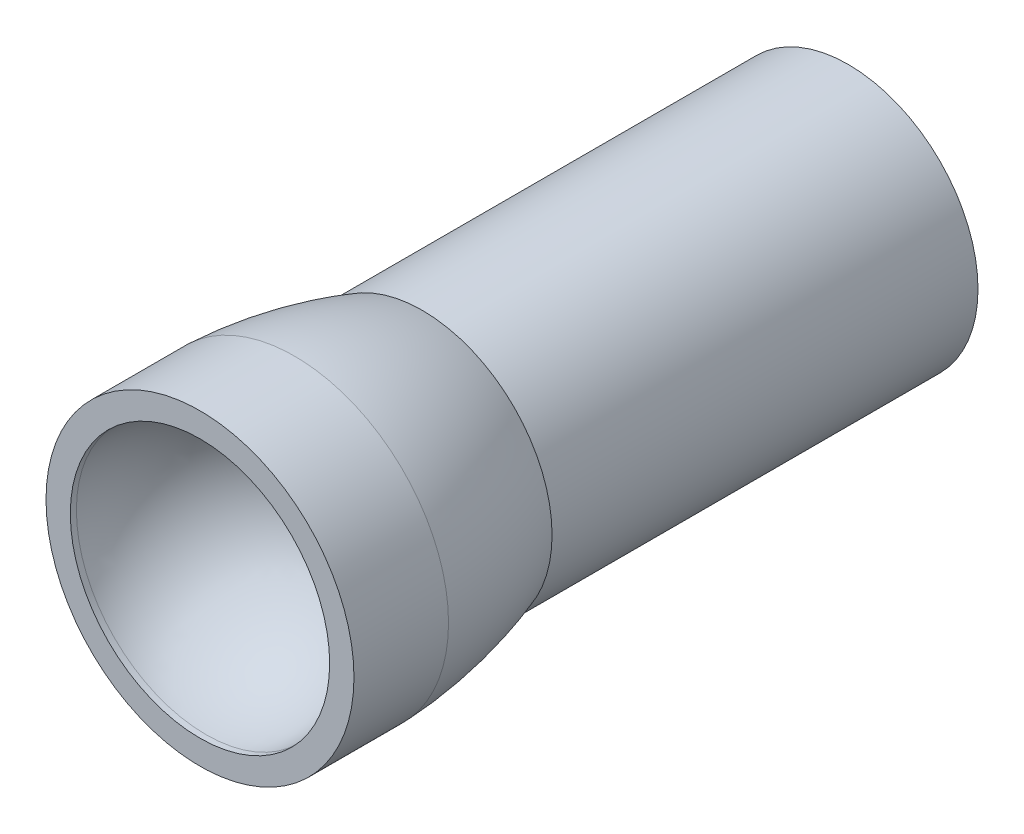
ISO-10303-21;
HEADER;
FILE_DESCRIPTION(('STEP AP214'),'2;1');
FILE_NAME('part.step','',(''),(''),'','','');
FILE_SCHEMA(('AUTOMOTIVE_DESIGN { 1 0 10303 214 1 1 1 1 }'));
ENDSEC;
DATA;
#1=APPLICATION_CONTEXT('core data for automotive mechanical design processes');
#2=APPLICATION_PROTOCOL_DEFINITION('international standard','automotive_design',2000,#1);
#3=PRODUCT_CONTEXT('',#1,'mechanical');
#4=PRODUCT('Part','Part','',(#3));
#5=PRODUCT_RELATED_PRODUCT_CATEGORY('part','',(#4));
#6=PRODUCT_DEFINITION_FORMATION('','',#4);
#7=PRODUCT_DEFINITION_CONTEXT('part definition',#1,'design');
#8=PRODUCT_DEFINITION('design','',#6,#7);
#9=PRODUCT_DEFINITION_SHAPE('','',#8);
#10=(LENGTH_UNIT() NAMED_UNIT(*) SI_UNIT(.MILLI.,.METRE.));
#11=(NAMED_UNIT(*) PLANE_ANGLE_UNIT() SI_UNIT($,.RADIAN.));
#12=(NAMED_UNIT(*) SI_UNIT($,.STERADIAN.) SOLID_ANGLE_UNIT());
#13=UNCERTAINTY_MEASURE_WITH_UNIT(LENGTH_MEASURE(1.E-05),#10,'distance_accuracy_value','');
#14=(GEOMETRIC_REPRESENTATION_CONTEXT(3) GLOBAL_UNCERTAINTY_ASSIGNED_CONTEXT((#13)) GLOBAL_UNIT_ASSIGNED_CONTEXT((#10,
#11,#12)) REPRESENTATION_CONTEXT('',''));
#15=CARTESIAN_POINT('',(0.,0.,0.));
#16=DIRECTION('',(0.,0.,1.));
#17=DIRECTION('',(1.,0.,0.));
#18=AXIS2_PLACEMENT_3D('',#15,#16,#17);
#19=CARTESIAN_POINT('',(0.,0.,25.));
#20=DIRECTION('',(0.,0.,-1.));
#21=DIRECTION('',(-1.,0.,0.));
#22=AXIS2_PLACEMENT_3D('',#19,#20,#21);
#23=CYLINDRICAL_SURFACE('',#22,6.25);
#24=CARTESIAN_POINT('',(0.,0.,7.));
#25=DIRECTION('',(0.,0.,-1.));
#26=DIRECTION('',(-1.,0.,0.));
#27=AXIS2_PLACEMENT_3D('',#24,#25,#26);
#28=CIRCLE('',#27,6.25);
#29=CARTESIAN_POINT('',(-6.25,0.,7.));
#30=VERTEX_POINT('',#29);
#31=EDGE_CURVE('E35',#30,#30,#28,.F.);
#32=ORIENTED_EDGE('',*,*,#31,.T.);
#33=EDGE_LOOP('',(#32));
#34=FACE_BOUND('',#33,.T.);
#35=CARTESIAN_POINT('',(0.,0.,0.));
#36=DIRECTION('',(0.,0.,-1.));
#37=DIRECTION('',(-1.,0.,0.));
#38=AXIS2_PLACEMENT_3D('',#35,#36,#37);
#39=CIRCLE('',#38,6.25);
#40=CARTESIAN_POINT('',(-6.25,0.,0.));
#41=VERTEX_POINT('',#40);
#42=EDGE_CURVE('E44',#41,#41,#39,.T.);
#43=ORIENTED_EDGE('',*,*,#42,.T.);
#44=EDGE_LOOP('',(#43));
#45=FACE_BOUND('',#44,.T.);
#46=ADVANCED_FACE('F31',(#34,#45),#23,.F.);
#47=CARTESIAN_POINT('',(0.,0.,0.));
#48=DIRECTION('',(0.,0.,1.));
#49=DIRECTION('',(1.,0.,0.));
#50=AXIS2_PLACEMENT_3D('',#47,#48,#49);
#51=CYLINDRICAL_SURFACE('',#50,2.4);
#52=CARTESIAN_POINT('',(0.,0.,25.));
#53=DIRECTION('',(0.,0.,-1.));
#54=DIRECTION('',(-1.,0.,0.));
#55=AXIS2_PLACEMENT_3D('',#52,#53,#54);
#56=CIRCLE('',#55,2.4);
#57=CARTESIAN_POINT('',(-2.4,0.,25.));
#58=VERTEX_POINT('',#57);
#59=EDGE_CURVE('E69',#58,#58,#56,.T.);
#60=ORIENTED_EDGE('',*,*,#59,.T.);
#61=EDGE_LOOP('',(#60));
#62=FACE_BOUND('',#61,.T.);
#63=CARTESIAN_POINT('',(0.,0.,32.));
#64=DIRECTION('',(0.,0.,1.));
#65=DIRECTION('',(1.,0.,0.));
#66=AXIS2_PLACEMENT_3D('',#63,#64,#65);
#67=CIRCLE('',#66,2.4);
#68=CARTESIAN_POINT('',(2.4,0.,32.));
#69=VERTEX_POINT('',#68);
#70=EDGE_CURVE('E47',#69,#69,#67,.F.);
#71=ORIENTED_EDGE('',*,*,#70,.F.);
#72=EDGE_LOOP('',(#71));
#73=FACE_BOUND('',#72,.T.);
#74=ADVANCED_FACE('F78',(#62,#73),#51,.F.);
#75=CARTESIAN_POINT('',(0.,0.,40.));
#76=DIRECTION('',(0.,0.,1.));
#77=DIRECTION('',(1.,0.,0.));
#78=AXIS2_PLACEMENT_3D('',#75,#76,#77);
#79=PLANE('',#78);
#80=CARTESIAN_POINT('',(0.,0.,40.));
#81=DIRECTION('',(0.,0.,1.));
#82=DIRECTION('',(1.,0.,0.));
#83=AXIS2_PLACEMENT_3D('',#80,#81,#82);
#84=CIRCLE('',#83,9.5);
#85=CARTESIAN_POINT('',(9.5,0.,40.));
#86=VERTEX_POINT('',#85);
#87=EDGE_CURVE('E62',#86,#86,#84,.T.);
#88=ORIENTED_EDGE('',*,*,#87,.T.);
#89=EDGE_LOOP('',(#88));
#90=FACE_BOUND('',#89,.T.);
#91=CARTESIAN_POINT('',(0.,0.,40.));
#92=DIRECTION('',(0.,0.,1.));
#93=DIRECTION('',(1.,0.,0.));
#94=AXIS2_PLACEMENT_3D('',#91,#92,#93);
#95=CIRCLE('',#94,8.);
#96=CARTESIAN_POINT('',(8.,0.,40.));
#97=VERTEX_POINT('',#96);
#98=EDGE_CURVE('E55',#97,#97,#95,.T.);
#99=ORIENTED_EDGE('',*,*,#98,.F.);
#100=EDGE_LOOP('',(#99));
#101=FACE_BOUND('',#100,.T.);
#102=ADVANCED_FACE('F33',(#90,#101),#79,.T.);
#103=CARTESIAN_POINT('',(0.,0.,0.));
#104=DIRECTION('',(0.,0.,1.));
#105=DIRECTION('',(1.,0.,0.));
#106=AXIS2_PLACEMENT_3D('',#103,#104,#105);
#107=PLANE('',#106);
#108=CARTESIAN_POINT('',(0.,0.,0.));
#109=DIRECTION('',(0.,0.,1.));
#110=DIRECTION('',(1.,0.,0.));
#111=AXIS2_PLACEMENT_3D('',#108,#109,#110);
#112=CIRCLE('',#111,8.);
#113=CARTESIAN_POINT('',(8.,0.,0.));
#114=VERTEX_POINT('',#113);
#115=EDGE_CURVE('E105',#114,#114,#112,.T.);
#116=ORIENTED_EDGE('',*,*,#115,.F.);
#117=EDGE_LOOP('',(#116));
#118=FACE_BOUND('',#117,.T.);
#119=ORIENTED_EDGE('',*,*,#42,.F.);
#120=EDGE_LOOP('',(#119));
#121=FACE_BOUND('',#120,.T.);
#122=ADVANCED_FACE('F85',(#118,#121),#107,.F.);
#123=CARTESIAN_POINT('',(0.,0.,8.5));
#124=DIRECTION('',(0.,0.,1.));
#125=DIRECTION('',(1.,0.,0.));
#126=AXIS2_PLACEMENT_3D('',#123,#124,#125);
#127=CIRCLE('',#126,6.25);
#128=CARTESIAN_POINT('',(6.25,0.,8.5));
#129=VERTEX_POINT('',#128);
#130=EDGE_CURVE('E49',#129,#129,#127,.F.);
#131=ORIENTED_EDGE('',*,*,#130,.T.);
#132=EDGE_LOOP('',(#131));
#133=FACE_BOUND('',#132,.T.);
#134=CARTESIAN_POINT('',(0.,0.,25.));
#135=DIRECTION('',(0.,0.,-1.));
#136=DIRECTION('',(-1.,0.,0.));
#137=AXIS2_PLACEMENT_3D('',#134,#135,#136);
#138=CIRCLE('',#137,6.25);
#139=CARTESIAN_POINT('',(-6.25,0.,25.));
#140=VERTEX_POINT('',#139);
#141=EDGE_CURVE('E39',#140,#140,#138,.T.);
#142=ORIENTED_EDGE('',*,*,#141,.F.);
#143=EDGE_LOOP('',(#142));
#144=FACE_BOUND('',#143,.T.);
#145=ADVANCED_FACE('F89',(#133,#144),#23,.F.);
#146=CARTESIAN_POINT('',(0.,0.,25.));
#147=DIRECTION('',(0.,0.,-1.));
#148=DIRECTION('',(-1.,0.,0.));
#149=AXIS2_PLACEMENT_3D('',#146,#147,#148);
#150=PLANE('',#149);
#151=ORIENTED_EDGE('',*,*,#59,.F.);
#152=EDGE_LOOP('',(#151));
#153=FACE_BOUND('',#152,.T.);
#154=ORIENTED_EDGE('',*,*,#141,.T.);
#155=EDGE_LOOP('',(#154));
#156=FACE_BOUND('',#155,.T.);
#157=ADVANCED_FACE('F94',(#153,#156),#150,.T.);
#158=CARTESIAN_POINT('',(0.,0.,32.));
#159=DIRECTION('',(0.,0.,1.));
#160=DIRECTION('',(1.,0.,0.));
#161=AXIS2_PLACEMENT_3D('',#158,#159,#160);
#162=CYLINDRICAL_SURFACE('',#161,8.);
#163=CARTESIAN_POINT('',(0.,0.,39.6241720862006));
#164=DIRECTION('',(0.,0.,-1.));
#165=DIRECTION('',(-1.,0.,0.));
#166=AXIS2_PLACEMENT_3D('',#163,#164,#165);
#167=CIRCLE('',#166,8.);
#168=CARTESIAN_POINT('',(-8.,0.,39.6241720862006));
#169=VERTEX_POINT('',#168);
#170=EDGE_CURVE('E10',#169,#169,#167,.T.);
#171=ORIENTED_EDGE('',*,*,#170,.T.);
#172=EDGE_LOOP('',(#171));
#173=FACE_BOUND('',#172,.T.);
#174=ORIENTED_EDGE('',*,*,#98,.T.);
#175=EDGE_LOOP('',(#174));
#176=FACE_BOUND('',#175,.T.);
#177=ADVANCED_FACE('F92',(#173,#176),#162,.F.);
#178=CARTESIAN_POINT('',(0.,0.,39.6241720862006));
#179=DIRECTION('',(0.,0.,-1.));
#180=DIRECTION('',(-1.,0.,0.));
#181=AXIS2_PLACEMENT_3D('',#178,#179,#180);
#182=DEGENERATE_TOROIDAL_SURFACE('',#181,0.00999999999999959,7.99,.T.);
#183=ORIENTED_EDGE('',*,*,#170,.F.);
#184=EDGE_LOOP('',(#183));
#185=FACE_BOUND('',#184,.T.);
#186=ORIENTED_EDGE('',*,*,#70,.T.);
#187=EDGE_LOOP('',(#186));
#188=FACE_BOUND('',#187,.T.);
#189=ADVANCED_FACE('F76',(#185,#188),#182,.F.);
#190=CARTESIAN_POINT('',(0.,7.,7.));
#191=DIRECTION('',(0.,0.,-1.));
#192=DIRECTION('',(-1.,0.,0.));
#193=AXIS2_PLACEMENT_3D('',#190,#191,#192);
#194=PLANE('',#193);
#195=CARTESIAN_POINT('',(0.,0.,7.));
#196=DIRECTION('',(0.,0.,-1.));
#197=DIRECTION('',(-1.,0.,0.));
#198=AXIS2_PLACEMENT_3D('',#195,#196,#197);
#199=CIRCLE('',#198,7.);
#200=CARTESIAN_POINT('',(-7.,0.,7.));
#201=VERTEX_POINT('',#200);
#202=EDGE_CURVE('E57',#201,#201,#199,.T.);
#203=ORIENTED_EDGE('',*,*,#202,.F.);
#204=EDGE_LOOP('',(#203));
#205=FACE_BOUND('',#204,.T.);
#206=ORIENTED_EDGE('',*,*,#31,.F.);
#207=EDGE_LOOP('',(#206));
#208=FACE_BOUND('',#207,.T.);
#209=ADVANCED_FACE('F145',(#205,#208),#194,.F.);
#210=CARTESIAN_POINT('',(0.,7.,8.5));
#211=DIRECTION('',(0.,0.,1.));
#212=DIRECTION('',(1.,0.,0.));
#213=AXIS2_PLACEMENT_3D('',#210,#211,#212);
#214=PLANE('',#213);
#215=CARTESIAN_POINT('',(0.,0.,8.5));
#216=DIRECTION('',(0.,0.,-1.));
#217=DIRECTION('',(-1.,0.,0.));
#218=AXIS2_PLACEMENT_3D('',#215,#216,#217);
#219=CIRCLE('',#218,7.);
#220=CARTESIAN_POINT('',(-7.,0.,8.5));
#221=VERTEX_POINT('',#220);
#222=EDGE_CURVE('E51',#221,#221,#219,.T.);
#223=ORIENTED_EDGE('',*,*,#222,.T.);
#224=EDGE_LOOP('',(#223));
#225=FACE_BOUND('',#224,.T.);
#226=ORIENTED_EDGE('',*,*,#130,.F.);
#227=EDGE_LOOP('',(#226));
#228=FACE_BOUND('',#227,.T.);
#229=ADVANCED_FACE('F141',(#225,#228),#214,.F.);
#230=CARTESIAN_POINT('',(0.,0.,0.));
#231=DIRECTION('',(0.,0.,-1.));
#232=DIRECTION('',(-1.,0.,0.));
#233=AXIS2_PLACEMENT_3D('',#230,#231,#232);
#234=CYLINDRICAL_SURFACE('',#233,7.);
#235=ORIENTED_EDGE('',*,*,#222,.F.);
#236=EDGE_LOOP('',(#235));
#237=FACE_BOUND('',#236,.T.);
#238=ORIENTED_EDGE('',*,*,#202,.T.);
#239=EDGE_LOOP('',(#238));
#240=FACE_BOUND('',#239,.T.);
#241=ADVANCED_FACE('F124',(#237,#240),#234,.F.);
#242=CARTESIAN_POINT('',(0.,0.,47.304854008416));
#243=DIRECTION('',(0.,0.,1.));
#244=DIRECTION('',(1.,0.,0.));
#245=AXIS2_PLACEMENT_3D('',#242,#243,#244);
#246=CYLINDRICAL_SURFACE('',#245,9.5);
#247=ORIENTED_EDGE('',*,*,#87,.F.);
#248=EDGE_LOOP('',(#247));
#249=FACE_BOUND('',#248,.T.);
#250=CARTESIAN_POINT('',(0.,0.,34.1659289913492));
#251=DIRECTION('',(0.,0.,1.));
#252=DIRECTION('',(1.,0.,0.));
#253=AXIS2_PLACEMENT_3D('',#250,#251,#252);
#254=CIRCLE('',#253,9.5);
#255=CARTESIAN_POINT('',(9.5,0.,34.1659289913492));
#256=VERTEX_POINT('',#255);
#257=EDGE_CURVE('E112',#256,#256,#254,.T.);
#258=ORIENTED_EDGE('',*,*,#257,.T.);
#259=EDGE_LOOP('',(#258));
#260=FACE_BOUND('',#259,.T.);
#261=ADVANCED_FACE('F120',(#249,#260),#246,.T.);
#262=CARTESIAN_POINT('',(0.,0.,35.5140817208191));
#263=DIRECTION('',(0.,0.,1.));
#264=DIRECTION('',(1.,0.,0.));
#265=AXIS2_PLACEMENT_3D('',#262,#263,#264);
#266=DEGENERATE_TOROIDAL_SURFACE('',#265,19.07430585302,28.6060914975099,.F.);
#267=ORIENTED_EDGE('',*,*,#257,.F.);
#268=EDGE_LOOP('',(#267));
#269=FACE_BOUND('',#268,.T.);
#270=CARTESIAN_POINT('',(0.,0.,26.2787997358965));
#271=DIRECTION('',(0.,0.,1.));
#272=DIRECTION('',(1.,0.,0.));
#273=AXIS2_PLACEMENT_3D('',#270,#271,#272);
#274=CIRCLE('',#273,8.);
#275=CARTESIAN_POINT('',(8.,0.,26.2787997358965));
#276=VERTEX_POINT('',#275);
#277=EDGE_CURVE('E109',#276,#276,#274,.T.);
#278=ORIENTED_EDGE('',*,*,#277,.T.);
#279=EDGE_LOOP('',(#278));
#280=FACE_BOUND('',#279,.T.);
#281=ADVANCED_FACE('F123',(#269,#280),#266,.F.);
#282=CARTESIAN_POINT('',(0.,0.,47.304854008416));
#283=DIRECTION('',(0.,0.,1.));
#284=DIRECTION('',(1.,0.,0.));
#285=AXIS2_PLACEMENT_3D('',#282,#283,#284);
#286=CYLINDRICAL_SURFACE('',#285,8.);
#287=ORIENTED_EDGE('',*,*,#277,.F.);
#288=EDGE_LOOP('',(#287));
#289=FACE_BOUND('',#288,.T.);
#290=ORIENTED_EDGE('',*,*,#115,.T.);
#291=EDGE_LOOP('',(#290));
#292=FACE_BOUND('',#291,.T.);
#293=ADVANCED_FACE('F130',(#289,#292),#286,.T.);
#294=CLOSED_SHELL('',(#46,#74,#102,#122,#145,#157,#177,#189,#209,#229,#241,#261,#281,#293));
#295=MANIFOLD_SOLID_BREP('B2',#294);
#296=ADVANCED_BREP_SHAPE_REPRESENTATION('',(#18,#295),#14);
#297=SHAPE_DEFINITION_REPRESENTATION(#9,#296);
ENDSEC;
END-ISO-10303-21;
